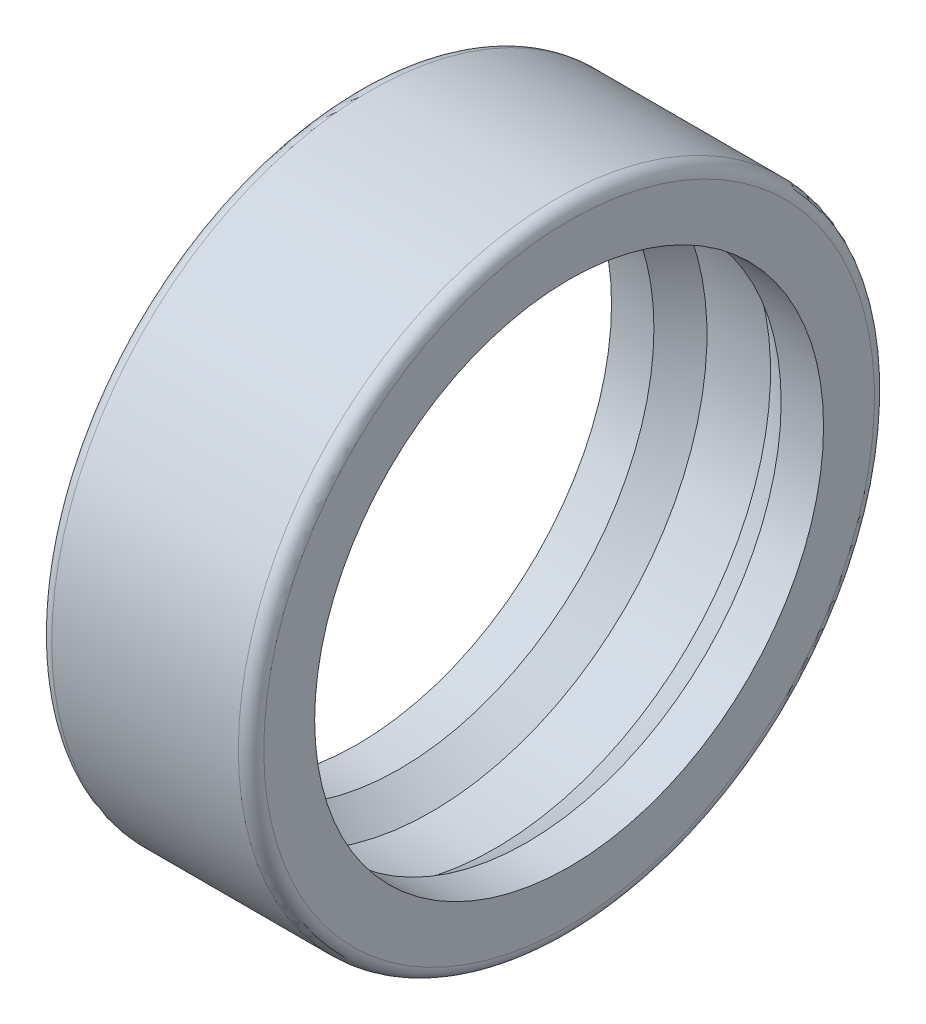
ISO-10303-21;
HEADER;
FILE_DESCRIPTION(('STEP AP214'),'2;1');
FILE_NAME('part.step','',(''),(''),'','','');
FILE_SCHEMA(('AUTOMOTIVE_DESIGN { 1 0 10303 214 1 1 1 1 }'));
ENDSEC;
DATA;
#1=APPLICATION_CONTEXT('core data for automotive mechanical design processes');
#2=APPLICATION_PROTOCOL_DEFINITION('international standard','automotive_design',2000,#1);
#3=PRODUCT_CONTEXT('',#1,'mechanical');
#4=PRODUCT('Part','Part','',(#3));
#5=PRODUCT_RELATED_PRODUCT_CATEGORY('part','',(#4));
#6=PRODUCT_DEFINITION_FORMATION('','',#4);
#7=PRODUCT_DEFINITION_CONTEXT('part definition',#1,'design');
#8=PRODUCT_DEFINITION('design','',#6,#7);
#9=PRODUCT_DEFINITION_SHAPE('','',#8);
#10=(LENGTH_UNIT() NAMED_UNIT(*) SI_UNIT(.MILLI.,.METRE.));
#11=(NAMED_UNIT(*) PLANE_ANGLE_UNIT() SI_UNIT($,.RADIAN.));
#12=(NAMED_UNIT(*) SI_UNIT($,.STERADIAN.) SOLID_ANGLE_UNIT());
#13=UNCERTAINTY_MEASURE_WITH_UNIT(LENGTH_MEASURE(1.E-05),#10,'distance_accuracy_value','');
#14=(GEOMETRIC_REPRESENTATION_CONTEXT(3) GLOBAL_UNCERTAINTY_ASSIGNED_CONTEXT((#13)) GLOBAL_UNIT_ASSIGNED_CONTEXT((#10,
#11,#12)) REPRESENTATION_CONTEXT('',''));
#15=CARTESIAN_POINT('',(0.,0.,0.));
#16=DIRECTION('',(0.,0.,1.));
#17=DIRECTION('',(1.,0.,0.));
#18=AXIS2_PLACEMENT_3D('',#15,#16,#17);
#19=CARTESIAN_POINT('',(-2.5,7.5,0.));
#20=DIRECTION('',(1.,0.,0.));
#21=DIRECTION('',(0.,0.,-1.));
#22=AXIS2_PLACEMENT_3D('',#19,#20,#21);
#23=PLANE('',#22);
#24=CARTESIAN_POINT('',(-2.5,0.,0.));
#25=DIRECTION('',(1.,0.,0.));
#26=DIRECTION('',(0.,0.,-1.));
#27=AXIS2_PLACEMENT_3D('',#24,#25,#26);
#28=CIRCLE('',#27,7.2);
#29=CARTESIAN_POINT('',(-2.5,0.,-7.2));
#30=VERTEX_POINT('',#29);
#31=EDGE_CURVE('E10',#30,#30,#28,.F.);
#32=ORIENTED_EDGE('',*,*,#31,.T.);
#33=EDGE_LOOP('',(#32));
#34=FACE_BOUND('',#33,.T.);
#35=CARTESIAN_POINT('',(-2.5,0.,0.));
#36=DIRECTION('',(-1.,0.,0.));
#37=DIRECTION('',(0.,0.,1.));
#38=AXIS2_PLACEMENT_3D('',#35,#36,#37);
#39=CIRCLE('',#38,6.);
#40=CARTESIAN_POINT('',(-2.5,0.,6.));
#41=VERTEX_POINT('',#40);
#42=EDGE_CURVE('E66',#41,#41,#39,.T.);
#43=ORIENTED_EDGE('',*,*,#42,.F.);
#44=EDGE_LOOP('',(#43));
#45=FACE_BOUND('',#44,.T.);
#46=ADVANCED_FACE('F31',(#34,#45),#23,.F.);
#47=CARTESIAN_POINT('',(-2.5,0.,0.));
#48=DIRECTION('',(-1.,0.,0.));
#49=DIRECTION('',(0.,0.,1.));
#50=AXIS2_PLACEMENT_3D('',#47,#48,#49);
#51=CYLINDRICAL_SURFACE('',#50,7.5);
#52=CARTESIAN_POINT('',(2.2,0.,0.));
#53=DIRECTION('',(-1.,0.,0.));
#54=DIRECTION('',(0.,0.,1.));
#55=AXIS2_PLACEMENT_3D('',#52,#53,#54);
#56=CIRCLE('',#55,7.5);
#57=CARTESIAN_POINT('',(2.2,0.,7.5));
#58=VERTEX_POINT('',#57);
#59=EDGE_CURVE('E42',#58,#58,#56,.T.);
#60=ORIENTED_EDGE('',*,*,#59,.T.);
#61=EDGE_LOOP('',(#60));
#62=FACE_BOUND('',#61,.T.);
#63=CARTESIAN_POINT('',(-2.2,0.,0.));
#64=DIRECTION('',(1.,0.,0.));
#65=DIRECTION('',(0.,0.,-1.));
#66=AXIS2_PLACEMENT_3D('',#63,#64,#65);
#67=CIRCLE('',#66,7.5);
#68=CARTESIAN_POINT('',(-2.2,0.,-7.5));
#69=VERTEX_POINT('',#68);
#70=EDGE_CURVE('E46',#69,#69,#67,.T.);
#71=ORIENTED_EDGE('',*,*,#70,.T.);
#72=EDGE_LOOP('',(#71));
#73=FACE_BOUND('',#72,.T.);
#74=ADVANCED_FACE('F73',(#62,#73),#51,.T.);
#75=CARTESIAN_POINT('',(2.5,7.5,0.));
#76=DIRECTION('',(-1.,0.,0.));
#77=DIRECTION('',(0.,0.,1.));
#78=AXIS2_PLACEMENT_3D('',#75,#76,#77);
#79=PLANE('',#78);
#80=CARTESIAN_POINT('',(2.5,0.,0.));
#81=DIRECTION('',(-1.,0.,0.));
#82=DIRECTION('',(0.,0.,1.));
#83=AXIS2_PLACEMENT_3D('',#80,#81,#82);
#84=CIRCLE('',#83,7.2);
#85=CARTESIAN_POINT('',(2.5,0.,7.2));
#86=VERTEX_POINT('',#85);
#87=EDGE_CURVE('E38',#86,#86,#84,.F.);
#88=ORIENTED_EDGE('',*,*,#87,.T.);
#89=EDGE_LOOP('',(#88));
#90=FACE_BOUND('',#89,.T.);
#91=CARTESIAN_POINT('',(2.5,0.,0.));
#92=DIRECTION('',(-1.,0.,0.));
#93=DIRECTION('',(0.,0.,1.));
#94=AXIS2_PLACEMENT_3D('',#91,#92,#93);
#95=CIRCLE('',#94,6.);
#96=CARTESIAN_POINT('',(2.5,0.,6.));
#97=VERTEX_POINT('',#96);
#98=EDGE_CURVE('E51',#97,#97,#95,.T.);
#99=ORIENTED_EDGE('',*,*,#98,.T.);
#100=EDGE_LOOP('',(#99));
#101=FACE_BOUND('',#100,.T.);
#102=ADVANCED_FACE('F79',(#90,#101),#79,.F.);
#103=CARTESIAN_POINT('',(-2.5,0.,0.));
#104=DIRECTION('',(-1.,0.,0.));
#105=DIRECTION('',(0.,0.,1.));
#106=AXIS2_PLACEMENT_3D('',#103,#104,#105);
#107=CYLINDRICAL_SURFACE('',#106,6.);
#108=ORIENTED_EDGE('',*,*,#98,.F.);
#109=EDGE_LOOP('',(#108));
#110=FACE_BOUND('',#109,.T.);
#111=CARTESIAN_POINT('',(1.5,0.,0.));
#112=DIRECTION('',(-1.,0.,0.));
#113=DIRECTION('',(0.,0.,1.));
#114=AXIS2_PLACEMENT_3D('',#111,#112,#113);
#115=CIRCLE('',#114,6.);
#116=CARTESIAN_POINT('',(1.5,0.,6.));
#117=VERTEX_POINT('',#116);
#118=EDGE_CURVE('E54',#117,#117,#115,.T.);
#119=ORIENTED_EDGE('',*,*,#118,.T.);
#120=EDGE_LOOP('',(#119));
#121=FACE_BOUND('',#120,.T.);
#122=ADVANCED_FACE('F112',(#110,#121),#107,.F.);
#123=CARTESIAN_POINT('',(0.75,0.,0.));
#124=DIRECTION('',(-1.,0.,0.));
#125=DIRECTION('',(0.,0.,1.));
#126=AXIS2_PLACEMENT_3D('',#123,#124,#125);
#127=CONICAL_SURFACE('',#126,6.5,0.588002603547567);
#128=ORIENTED_EDGE('',*,*,#118,.F.);
#129=EDGE_LOOP('',(#128));
#130=FACE_BOUND('',#129,.T.);
#131=CARTESIAN_POINT('',(0.75,0.,0.));
#132=DIRECTION('',(-1.,0.,0.));
#133=DIRECTION('',(0.,0.,1.));
#134=AXIS2_PLACEMENT_3D('',#131,#132,#133);
#135=CIRCLE('',#134,6.5);
#136=CARTESIAN_POINT('',(0.75,0.,6.5));
#137=VERTEX_POINT('',#136);
#138=EDGE_CURVE('E57',#137,#137,#135,.T.);
#139=ORIENTED_EDGE('',*,*,#138,.T.);
#140=EDGE_LOOP('',(#139));
#141=FACE_BOUND('',#140,.T.);
#142=ADVANCED_FACE('F108',(#130,#141),#127,.F.);
#143=CARTESIAN_POINT('',(-2.5,0.,0.));
#144=DIRECTION('',(-1.,0.,0.));
#145=DIRECTION('',(0.,0.,1.));
#146=AXIS2_PLACEMENT_3D('',#143,#144,#145);
#147=CYLINDRICAL_SURFACE('',#146,6.5);
#148=ORIENTED_EDGE('',*,*,#138,.F.);
#149=EDGE_LOOP('',(#148));
#150=FACE_BOUND('',#149,.T.);
#151=CARTESIAN_POINT('',(-0.75,0.,0.));
#152=DIRECTION('',(-1.,0.,0.));
#153=DIRECTION('',(0.,0.,1.));
#154=AXIS2_PLACEMENT_3D('',#151,#152,#153);
#155=CIRCLE('',#154,6.5);
#156=CARTESIAN_POINT('',(-0.75,0.,6.5));
#157=VERTEX_POINT('',#156);
#158=EDGE_CURVE('E60',#157,#157,#155,.T.);
#159=ORIENTED_EDGE('',*,*,#158,.T.);
#160=EDGE_LOOP('',(#159));
#161=FACE_BOUND('',#160,.T.);
#162=ADVANCED_FACE('F101',(#150,#161),#147,.F.);
#163=CARTESIAN_POINT('',(-1.5,0.,0.));
#164=DIRECTION('',(1.,0.,0.));
#165=DIRECTION('',(0.,0.,-1.));
#166=AXIS2_PLACEMENT_3D('',#163,#164,#165);
#167=CONICAL_SURFACE('',#166,6.,0.588002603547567);
#168=ORIENTED_EDGE('',*,*,#158,.F.);
#169=EDGE_LOOP('',(#168));
#170=FACE_BOUND('',#169,.T.);
#171=CARTESIAN_POINT('',(-1.5,0.,0.));
#172=DIRECTION('',(-1.,0.,0.));
#173=DIRECTION('',(0.,0.,1.));
#174=AXIS2_PLACEMENT_3D('',#171,#172,#173);
#175=CIRCLE('',#174,6.);
#176=CARTESIAN_POINT('',(-1.5,0.,6.));
#177=VERTEX_POINT('',#176);
#178=EDGE_CURVE('E63',#177,#177,#175,.T.);
#179=ORIENTED_EDGE('',*,*,#178,.T.);
#180=EDGE_LOOP('',(#179));
#181=FACE_BOUND('',#180,.T.);
#182=ADVANCED_FACE('F91',(#170,#181),#167,.F.);
#183=CARTESIAN_POINT('',(-2.5,0.,0.));
#184=DIRECTION('',(-1.,0.,0.));
#185=DIRECTION('',(0.,0.,1.));
#186=AXIS2_PLACEMENT_3D('',#183,#184,#185);
#187=CYLINDRICAL_SURFACE('',#186,6.);
#188=ORIENTED_EDGE('',*,*,#178,.F.);
#189=EDGE_LOOP('',(#188));
#190=FACE_BOUND('',#189,.T.);
#191=ORIENTED_EDGE('',*,*,#42,.T.);
#192=EDGE_LOOP('',(#191));
#193=FACE_BOUND('',#192,.T.);
#194=ADVANCED_FACE('F70',(#190,#193),#187,.F.);
#195=CARTESIAN_POINT('',(2.2,0.,0.));
#196=DIRECTION('',(-1.,0.,0.));
#197=DIRECTION('',(0.,0.,1.));
#198=AXIS2_PLACEMENT_3D('',#195,#196,#197);
#199=TOROIDAL_SURFACE('',#198,7.2,0.3);
#200=ORIENTED_EDGE('',*,*,#87,.F.);
#201=EDGE_LOOP('',(#200));
#202=FACE_BOUND('',#201,.T.);
#203=ORIENTED_EDGE('',*,*,#59,.F.);
#204=EDGE_LOOP('',(#203));
#205=FACE_BOUND('',#204,.T.);
#206=ADVANCED_FACE('F83',(#202,#205),#199,.T.);
#207=CARTESIAN_POINT('',(-2.2,0.,0.));
#208=DIRECTION('',(1.,0.,0.));
#209=DIRECTION('',(0.,0.,-1.));
#210=AXIS2_PLACEMENT_3D('',#207,#208,#209);
#211=TOROIDAL_SURFACE('',#210,7.2,0.3);
#212=ORIENTED_EDGE('',*,*,#70,.F.);
#213=EDGE_LOOP('',(#212));
#214=FACE_BOUND('',#213,.T.);
#215=ORIENTED_EDGE('',*,*,#31,.F.);
#216=EDGE_LOOP('',(#215));
#217=FACE_BOUND('',#216,.T.);
#218=ADVANCED_FACE('F33',(#214,#217),#211,.T.);
#219=CLOSED_SHELL('',(#46,#74,#102,#122,#142,#162,#182,#194,#206,#218));
#220=MANIFOLD_SOLID_BREP('B2',#219);
#221=ADVANCED_BREP_SHAPE_REPRESENTATION('',(#18,#220),#14);
#222=SHAPE_DEFINITION_REPRESENTATION(#9,#221);
ENDSEC;
END-ISO-10303-21;
